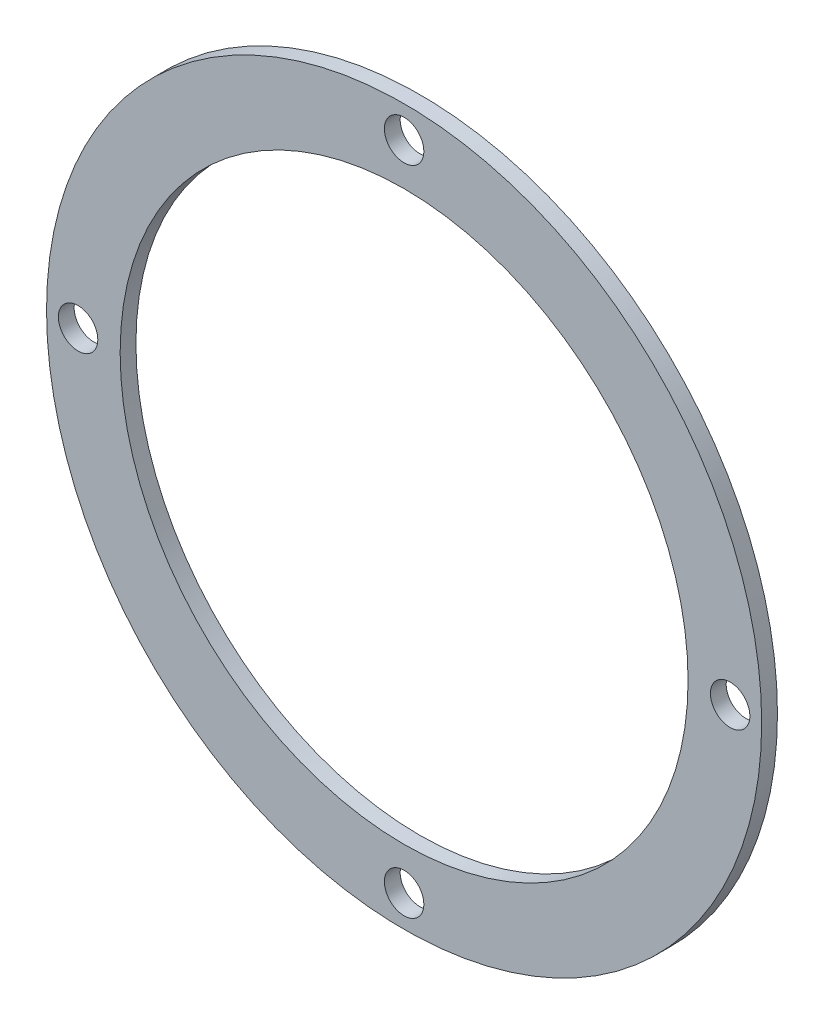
from build123d import *

# Parameters (mm, degrees)
ESQUISSE1_R          = 68
ESQUISSE1_R_2        = 54
ESQUISSE1_R_3        = 3.75
BASE_EXTRUSION_DEPTH = 3


with BuildPart() as part:
    # Esquisse1 → Base-Extrusion (new body)
    with BuildSketch(Plane.XY):
        Circle(ESQUISSE1_R)
        Circle(ESQUISSE1_R_2, mode=Mode.SUBTRACT)
        with Locations((0, 62)):
            Circle(ESQUISSE1_R_3, mode=Mode.SUBTRACT)
        with Locations((-62, 0)):
            Circle(ESQUISSE1_R_3, mode=Mode.SUBTRACT)
        with Locations((62, 0)):
            Circle(ESQUISSE1_R_3, mode=Mode.SUBTRACT)
        with Locations((0, -62)):
            Circle(ESQUISSE1_R_3, mode=Mode.SUBTRACT)
    extrude(amount=BASE_EXTRUSION_DEPTH)


solid = part.part
